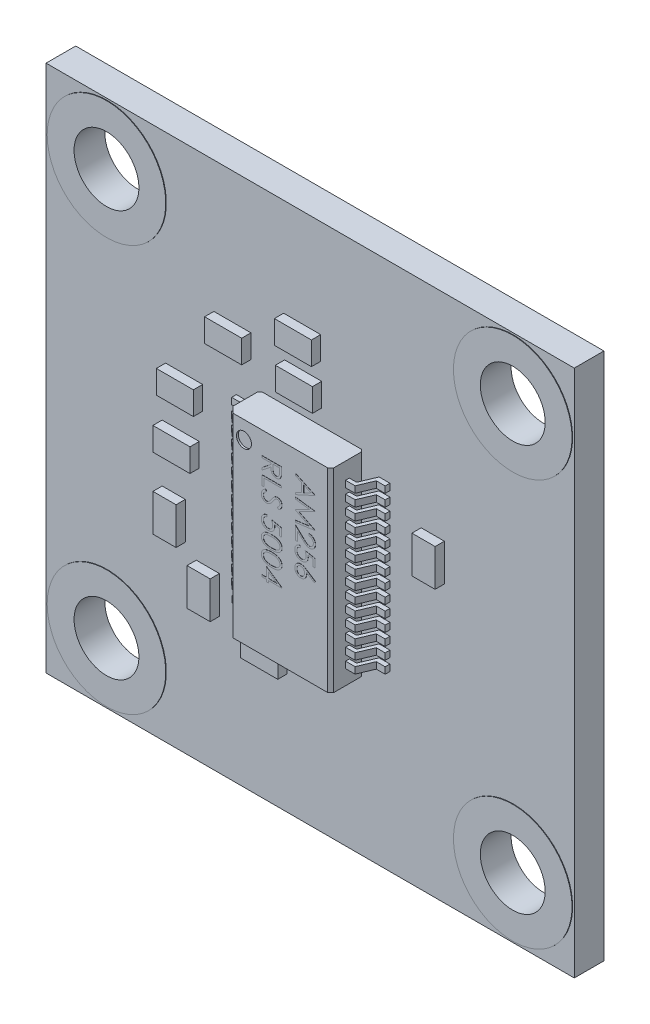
from build123d import *

# Parameters (mm, degrees)
SKETCH1_R                = 0.005
BASE_EXTRUDE_DEPTH       = 1.86
SKETCH5_R                = 0.404245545
CUT_EXTRUDE5_DEPTH       = 0.1
CUT_EXTRUDE9_DEPTH       = 11
BOSS_EXTRUDE1_DEPTH      = 0.01
SKETCH7_W                = 28.5
SKETCH7_H                = 28.5
SKETCH7_R                = 1.75
EXTRUDE1_DEPTH           = 1.6
SKETCH14_W               = 2.032996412
SKETCH14_H               = 4.399768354
BOSS_EXTRUDE2_DEPTH      = 1.8
SKETCH12_W               = 2
SKETCH12_H               = 1.25
SKETCH12_W_2             = 1.25
SKETCH12_H_2             = 2
EXTRUDE6_DEPTH           = 0.5
SKETCH13_W               = 1
SKETCH13_H               = 3
SKETCH13_W_2             = 3
SKETCH13_H_2             = 1
EXTRUDE7_DEPTH           = 0.05
SKETCH16_W               = 2.364526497
SKETCH16_H               = 0.264562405
CUT_EXTRUDE10_DEPTH      = 0.03
BOSS_EXTRUDE3_DEPTH      = 0.03
BOSS_EXTRUDE3_DEPTH_BACK = 1.63
SKETCH17_R               = 3.2
SKETCH17_R_2             = 1.75


with BuildPart() as part:
    # Sketch1 → Base-Extrude (new body)
    with BuildSketch(Plane.XY):
        Polygon((7.968512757, 8.897793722), (9.301851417, 8.897793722), (9.301851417, 8.547793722), (7.968512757, 8.547793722), (7.968512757, 8.247793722), (9.301851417, 8.247793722), (9.301851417, 7.897793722), (7.968512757, 7.897793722), (7.968512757, 7.597793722), (9.301851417, 7.597793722), (9.301851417, 7.247793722), (7.968512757, 7.247793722), (7.968512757, 6.947793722), (9.301851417, 6.947793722), (9.301851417, 6.597793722), (7.968512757, 6.597793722), (7.968512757, 6.297793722), (9.301851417, 6.297793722), (9.301851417, 5.947793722), (7.968512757, 5.947793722), (7.968512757, 5.647793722), (9.301851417, 5.647793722), (9.301851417, 5.297793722), (7.968512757, 5.297793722), (7.968512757, 4.997793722), (9.301851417, 4.997793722), (9.301851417, 4.647793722), (7.968512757, 4.647793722), (7.968512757, 4.347793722), (9.301851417, 4.347793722), (9.301851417, 3.997793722), (7.968512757, 3.997793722), (7.968512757, 3.697793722), (9.301851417, 3.697793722), (9.301851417, 3.347793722), (7.968512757, 3.347793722), (7.968512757, 3.047793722), (9.301851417, 3.047793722), (9.301851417, 2.697793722), (7.968512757, 2.697793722), (7.968512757, 2.397793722), (9.301851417, 2.397793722), (9.301851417, 2.047793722), (7.968512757, 2.047793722), (7.968512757, 1.747793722), (9.301851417, 1.747793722), (9.301851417, 1.397793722), (7.968512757, 1.397793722), (7.968512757, 1.097793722), (9.301851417, 1.097793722), (9.301851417, 0.747793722), (7.968512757, 0.747793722), (7.968512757, 0.447793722), (9.301851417, 0.447793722), (9.301851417, 0.097793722), (7.968512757, 0.097793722), (7.968512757, -0.702206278), (2.368512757, -0.702206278), (2.368512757, 0.097793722), (1.018512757, 0.097793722), (1.018512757, 0.447793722), (2.368512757, 0.447793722), (2.368512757, 0.747793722), (1.018512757, 0.747793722), (1.018512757, 1.097793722), (2.368512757, 1.097793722), (2.368512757, 1.397793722), (1.018512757, 1.397793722), (1.018512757, 1.747793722), (2.368512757, 1.747793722), (2.368512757, 2.047793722), (1.018512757, 2.047793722), (1.018512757, 2.397793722), (2.368512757, 2.397793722), (2.368512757, 2.697793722), (1.018512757, 2.697793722), (1.018512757, 3.047793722), (2.368512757, 3.047793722), (2.368512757, 3.347793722), (1.018512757, 3.347793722), (1.018512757, 3.697793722), (2.368512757, 3.697793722), (2.368512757, 3.997793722), (1.018512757, 3.997793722), (1.018512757, 4.347793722), (2.368512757, 4.347793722), (2.368512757, 4.647793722), (1.018512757, 4.647793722), (1.018512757, 4.997793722), (2.368512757, 4.997793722), (2.368512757, 5.297793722), (1.018512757, 5.297793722), (1.018512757, 5.647793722), (2.368512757, 5.647793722), (2.368512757, 5.947793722), (1.018512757, 5.947793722), (1.018512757, 6.297793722), (2.368512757, 6.297793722), (2.368512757, 6.597793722), (1.018512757, 6.597793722), (1.018512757, 6.947793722), (2.368512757, 6.947793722), (2.368512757, 7.247793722), (1.018512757, 7.247793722), (1.018512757, 7.597793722), (2.368512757, 7.597793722), (2.368512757, 7.897793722), (1.018512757, 7.897793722), (1.018512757, 8.247793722), (2.368512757, 8.247793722), (2.368512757, 8.547793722), (1.018512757, 8.547793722), (1.018512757, 8.897793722), (2.368512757, 8.897793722), (2.368512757, 9.797793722), (7.968512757, 9.797793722), align=None)
        with Locations((5.168512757, 4.547793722)):
            Circle(SKETCH1_R, mode=Mode.SUBTRACT)
    extrude(amount=BASE_EXTRUDE_DEPTH)

    # Sketch5 → Cut-Extrude5 (cut)
    with BuildSketch(Plane.XY.offset(1.86)):
        with Locations((3.288537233, 8.84582504)):
            Circle(SKETCH5_R)
    extrude(amount=-CUT_EXTRUDE5_DEPTH, mode=Mode.SUBTRACT)

    # Sketch15 → Cut-Extrude9 (cut)
    with BuildSketch(Plane(origin=(0, 9.797793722, 0), x_dir=(1, 0, 0), z_dir=(0, 1, 0))):
        Polygon((1.018512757, -0.2554117), (1.515038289, -0.2554117), (1.85430492, -1.060183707), (2.368512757, -1.060183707), (2.368512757, -1.533579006), (2.706416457, -1.86), (2.651187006, -2.385690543), (0.552467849, -2.385690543), (0.552467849, -0.2554117), align=None)
        Polygon((1.617607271, 0), (1.978441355, -0.855932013), (2.368512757, -0.855932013), (2.368512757, -0.187465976), (2.485498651, -0.081833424), (7.851526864, -0.081833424), (7.968512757, -0.187465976), (7.968512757, -0.855932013), (8.35858416, -0.855932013), (8.719418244, 0), align=None)
        Polygon((9.784557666, -2.385690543), (7.747123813, -2.38958058), (7.802761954, -1.86), (7.968512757, -1.696789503), (7.968512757, -1.060183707), (8.482720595, -1.060183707), (8.821987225, -0.2554117), (9.784557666, -0.2554117), align=None)
    extrude(amount=-CUT_EXTRUDE9_DEPTH, mode=Mode.SUBTRACT)

    # Sketch6 → Boss-Extrude1 (add)
    # profile 1 of 12: a face of its own
    with BuildSketch(Plane.XY.offset(1.86)):
        Polygon((7.124163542, 8.168306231), (6.065830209, 7.679844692), (6.065830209, 7.783091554), (6.40503961, 7.939551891), (6.40503961, 8.419321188), (6.065830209, 8.580233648), (6.065830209, 8.683904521), (7.124163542, 8.181874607), align=None)
        Polygon((6.917881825, 8.176150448), (6.513586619, 8.36780376), (6.513586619, 7.989585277), align=None, mode=Mode.SUBTRACT)
    # profile 2 of 12: a face of its own
    with BuildSketch(Plane.XY.offset(1.86)):
        Polygon((6.065830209, 7.571297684), (7.124163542, 7.431585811), (7.124163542, 7.418017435), (6.255787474, 6.981073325), (7.124163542, 6.545189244), (7.124163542, 6.531408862), (6.065830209, 6.390848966), (6.065830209, 6.48625161), (6.827355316, 6.587590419), (6.065830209, 6.969625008), (6.065830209, 6.991037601), (6.829051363, 7.374556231), (6.065830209, 7.475683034), align=None)
    # profile 3 of 12: a face of its own
    with BuildSketch(Plane.XY.offset(1.86)):
        with BuildLine():
            Line((6.798522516, 6.133049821), (6.798522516, 6.228028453))
            add(Edge.make_bspline(
                [(6.798522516, 6.228028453), (6.811123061, 6.227409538), (6.835870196, 6.226194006), (6.871950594, 6.220499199), (6.906441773, 6.212358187), (6.939048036, 6.200820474), (6.970158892, 6.186572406), (6.999361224, 6.169128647), (7.026944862, 6.148861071), (7.052387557, 6.125806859), (7.075645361, 6.100790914), (7.095942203, 6.073963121), (7.112894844, 6.045599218), (7.12714393, 6.015945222), (7.137826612, 5.984658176), (7.145756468, 5.952037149), (7.150526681, 5.917934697), (7.151039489, 5.894699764), (7.151300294, 5.882882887)],
                knots=[0, 0, 0, 0, 1.100776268, 2.161895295, 3.184016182, 4.190939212, 5.176500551, 6.166955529, 7.155448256, 8.160289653, 9.16017456, 10.133824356, 11.091467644, 12.04088621, 13.000931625, 13.972173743, 14.968683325, 16, 16, 16, 16], degree=3))
            add(Edge.make_bspline(
                [(7.151300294, 5.882882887), (7.151028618, 5.871278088), (7.150494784, 5.848475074), (7.145910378, 5.815194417), (7.138730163, 5.783511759), (7.128656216, 5.753489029), (7.115114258, 5.725365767), (7.098846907, 5.698930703), (7.080032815, 5.673869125), (7.057882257, 5.651309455), (7.034235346, 5.630593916), (7.008990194, 5.61272252), (6.9829161, 5.597418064), (6.95581424, 5.584661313), (6.927429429, 5.575270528), (6.898174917, 5.568140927), (6.867747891, 5.564110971), (6.847153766, 5.563492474), (6.836683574, 5.563178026)],
                knots=[0, 0, 0, 0, 1.111607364, 2.184268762, 3.212621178, 4.221274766, 5.211760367, 6.196651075, 7.1921475, 8.207485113, 9.220403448, 10.201281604, 11.166441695, 12.114753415, 13.065576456, 14.026450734, 14.996634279, 16, 16, 16, 16], degree=3))
            add(Edge.make_bspline(
                [(6.836683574, 5.563178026), (6.821943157, 5.563690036), (6.792720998, 5.564705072), (6.749778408, 5.573387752), (6.708172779, 5.586948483), (6.674687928, 5.603276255), (6.647705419, 5.619747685), (6.625489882, 5.634590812), (6.601569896, 5.651967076), (6.576025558, 5.672129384), (6.548656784, 5.694660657), (6.519480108, 5.719764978), (6.488796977, 5.747621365), (6.467840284, 5.767172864), (6.45698105, 5.777303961)],
                knots=[0, 0, 0, 0, 1.184426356, 2.348067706, 3.509069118, 4.696110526, 5.333549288, 6.050745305, 6.844228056, 7.710549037, 8.667450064, 9.695053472, 10.805634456, 12, 12, 12, 12], degree=3))
            Line((6.45698105, 5.777303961), (6.174377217, 6.0420993))
            Line((6.174377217, 6.0420993), (6.174377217, 5.54960965))
            Line((6.174377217, 5.54960965), (6.065830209, 5.54960965))
            Line((6.065830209, 5.54960965), (6.065830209, 6.268733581))
            Line((6.065830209, 6.268733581), (6.503834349, 5.858290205))
            add(Edge.make_bspline(
                [(6.503834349, 5.858290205), (6.514265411, 5.848296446), (6.534301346, 5.82910048), (6.563562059, 5.801961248), (6.590675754, 5.777546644), (6.615762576, 5.755840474), (6.638680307, 5.736824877), (6.659608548, 5.720560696), (6.678367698, 5.706976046), (6.700405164, 5.692579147), (6.727343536, 5.678850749), (6.760098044, 5.666784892), (6.793890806, 5.659480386), (6.816720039, 5.658599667), (6.828203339, 5.658156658)],
                knots=[0, 0, 0, 0, 1.329530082, 2.553755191, 3.672934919, 4.687409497, 5.60679272, 6.413407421, 7.126401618, 7.737995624, 8.834647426, 9.90044882, 10.943907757, 12, 12, 12, 12], degree=3))
            add(Edge.make_bspline(
                [(6.828203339, 5.658156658), (6.835425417, 5.65834692), (6.849658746, 5.658721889), (6.870513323, 5.662093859), (6.890707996, 5.667047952), (6.90999307, 5.674683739), (6.928747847, 5.683857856), (6.946402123, 5.695578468), (6.963557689, 5.708972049), (6.979626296, 5.724507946), (6.994347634, 5.741563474), (7.007387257, 5.759584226), (7.018284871, 5.778649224), (7.027218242, 5.798679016), (7.034226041, 5.819617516), (7.039081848, 5.841505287), (7.0421306, 5.864281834), (7.042543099, 5.879834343), (7.042753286, 5.887759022)],
                knots=[0, 0, 0, 0, 0.991504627, 1.954065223, 2.895985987, 3.842598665, 4.797835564, 5.759220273, 6.74786863, 7.784730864, 8.824135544, 9.839918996, 10.835834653, 11.835434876, 12.84861661, 13.863796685, 14.911511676, 16, 16, 16, 16], degree=3))
            add(Edge.make_bspline(
                [(7.042753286, 5.887759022), (7.042537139, 5.896035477), (7.042112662, 5.912289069), (7.039141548, 5.93615216), (7.034020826, 5.958919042), (7.027000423, 5.980635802), (7.018161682, 6.001323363), (7.006940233, 6.020794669), (6.993774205, 6.039227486), (6.978765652, 6.05658796), (6.961976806, 6.072539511), (6.943492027, 6.086849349), (6.923191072, 6.099054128), (6.901532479, 6.109873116), (6.877940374, 6.118151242), (6.852986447, 6.125227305), (6.826316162, 6.130367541), (6.80794094, 6.132140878), (6.798522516, 6.133049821)],
                knots=[0, 0, 0, 0, 1.031212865, 2.025131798, 2.990757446, 3.934781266, 4.865570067, 5.788494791, 6.729227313, 7.684356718, 8.643577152, 9.610526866, 10.590658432, 11.59095419, 12.621640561, 13.700587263, 14.82141059, 16, 16, 16, 16], degree=3))
        make_face()
    # profile 4 of 12: a face of its own
    with BuildSketch(Plane.XY.offset(1.86)):
        with BuildLine():
            Line((7.124163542, 4.78978059), (7.015616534, 4.78978059))
            Line((7.015616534, 4.78978059), (7.015616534, 5.149766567))
            Line((7.015616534, 5.149766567), (6.737252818, 5.206796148))
            add(Edge.make_bspline(
                [(6.737252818, 5.206796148), (6.740346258, 5.195591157), (6.746339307, 5.17388326), (6.752993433, 5.141843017), (6.75700465, 5.11142585), (6.757552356, 5.091687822), (6.757817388, 5.082136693)],
                knots=[0, 0, 0, 0, 1.100273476, 2.13160584, 3.095893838, 4, 4, 4, 4], degree=3))
            add(Edge.make_bspline(
                [(6.757817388, 5.082136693), (6.757561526, 5.070318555), (6.757058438, 5.047081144), (6.752229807, 5.013081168), (6.74462452, 4.980627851), (6.734017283, 4.949776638), (6.720365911, 4.920461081), (6.703534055, 4.89284489), (6.683638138, 4.866771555), (6.660870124, 4.842585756), (6.635781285, 4.82067843), (6.608893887, 4.801340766), (6.580183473, 4.78525807), (6.549776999, 4.772026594), (6.517725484, 4.761528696), (6.483791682, 4.754522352), (6.448276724, 4.749862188), (6.423994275, 4.749341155), (6.411611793, 4.749075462)],
                knots=[0, 0, 0, 0, 1.052772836, 2.070014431, 3.053871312, 4.019926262, 4.972333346, 5.930471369, 6.896690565, 7.89035727, 8.885779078, 9.861050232, 10.836829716, 11.812751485, 12.812646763, 13.836748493, 14.896881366, 16, 16, 16, 16], degree=3))
            add(Edge.make_bspline(
                [(6.411611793, 4.749075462), (6.402987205, 4.749276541), (6.385854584, 4.749675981), (6.360411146, 4.751707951), (6.335505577, 4.755617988), (6.31113825, 4.760875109), (6.287341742, 4.767671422), (6.264124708, 4.775988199), (6.24141566, 4.785791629), (6.219213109, 4.796859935), (6.198201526, 4.809663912), (6.178056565, 4.823151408), (6.159519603, 4.838091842), (6.141913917, 4.853761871), (6.12593091, 4.870788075), (6.1108866, 4.888641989), (6.097434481, 4.907742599), (6.085061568, 4.927747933), (6.073983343, 4.948645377), (6.064742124, 4.970646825), (6.056642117, 4.993269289), (6.050055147, 5.0167144), (6.044944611, 5.040936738), (6.041464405, 5.066019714), (6.038932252, 5.091837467), (6.038773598, 5.109337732), (6.038693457, 5.118177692)],
                knots=[0, 0, 0, 0, 1.05623316, 2.098192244, 3.122504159, 4.140841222, 5.148757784, 6.150489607, 7.158294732, 8.176043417, 9.185147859, 10.169157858, 11.142149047, 12.097904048, 13.0527185, 13.998867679, 14.954465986, 15.910220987, 16.877849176, 17.847023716, 18.829548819, 19.818454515, 20.826519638, 21.858115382, 22.918063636, 24, 24, 24, 24], degree=3))
            add(Edge.make_bspline(
                [(6.038693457, 5.118177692), (6.038902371, 5.128722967), (6.039313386, 5.14946955), (6.043612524, 5.179865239), (6.049771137, 5.209109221), (6.059031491, 5.236970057), (6.070651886, 5.263682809), (6.085245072, 5.288891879), (6.102013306, 5.313092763), (6.12153515, 5.33562771), (6.143072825, 5.356500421), (6.166194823, 5.375471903), (6.190993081, 5.392109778), (6.217256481, 5.406481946), (6.245030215, 5.41872349), (6.274397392, 5.428344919), (6.305210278, 5.43610924), (6.326423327, 5.439394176), (6.33719773, 5.441062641)],
                knots=[0, 0, 0, 0, 1.046825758, 2.059506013, 3.044032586, 4.011925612, 4.970610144, 5.93275819, 6.900651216, 7.891265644, 8.889116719, 9.876966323, 10.858259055, 11.851035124, 12.847502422, 13.86866322, 14.9174643, 16, 16, 16, 16], degree=3))
            Line((6.33719773, 5.441062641), (6.33719773, 5.346084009))
            add(Edge.make_bspline(
                [(6.33719773, 5.346084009), (6.327104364, 5.343748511), (6.307704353, 5.339259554), (6.280463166, 5.329380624), (6.256096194, 5.317376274), (6.234580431, 5.302777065), (6.215719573, 5.285714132), (6.19876674, 5.266383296), (6.183675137, 5.244509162), (6.171014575, 5.220211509), (6.160232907, 5.194562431), (6.153049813, 5.167721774), (6.148000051, 5.140415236), (6.147494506, 5.121946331), (6.147240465, 5.112665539)],
                knots=[0, 0, 0, 0, 1.136389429, 2.184203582, 3.172920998, 4.111012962, 5.028380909, 5.957351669, 6.927793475, 7.937618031, 8.960409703, 9.974842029, 10.982339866, 12, 12, 12, 12], degree=3))
            add(Edge.make_bspline(
                [(6.147240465, 5.112665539), (6.147488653, 5.103606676), (6.147977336, 5.085769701), (6.151738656, 5.059519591), (6.157531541, 5.034176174), (6.166200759, 5.009989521), (6.176737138, 4.986536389), (6.190258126, 4.964410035), (6.205818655, 4.942970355), (6.223646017, 4.922883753), (6.243291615, 4.904487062), (6.264300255, 4.888232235), (6.286711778, 4.874692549), (6.310138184, 4.863282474), (6.334836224, 4.854618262), (6.36069015, 4.848437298), (6.387763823, 4.844807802), (6.406230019, 4.844308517), (6.415639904, 4.844054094)],
                knots=[0, 0, 0, 0, 1.027316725, 2.022795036, 3.002884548, 3.971462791, 4.93288096, 5.914575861, 6.907176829, 7.935150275, 8.956128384, 9.956726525, 10.942570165, 11.921478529, 12.907843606, 13.90538589, 14.932640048, 16, 16, 16, 16], degree=3))
            add(Edge.make_bspline(
                [(6.415639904, 4.844054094), (6.424134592, 4.844221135), (6.440771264, 4.844548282), (6.465003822, 4.848183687), (6.488098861, 4.853276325), (6.509849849, 4.86109542), (6.530575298, 4.870756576), (6.549831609, 4.883013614), (6.568113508, 4.89702467), (6.584678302, 4.913435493), (6.600070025, 4.931330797), (6.613171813, 4.951125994), (6.624199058, 4.97236957), (6.633714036, 4.994815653), (6.640548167, 5.018995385), (6.645678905, 5.044430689), (6.648646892, 5.071396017), (6.6490587, 5.089832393), (6.64927038, 5.099309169)],
                knots=[0, 0, 0, 0, 1.045726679, 2.048034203, 3.01323695, 3.95502507, 4.889743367, 5.8246644, 6.761650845, 7.722168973, 8.692072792, 9.66525385, 10.638902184, 11.638179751, 12.663148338, 13.728659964, 14.832472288, 16, 16, 16, 16], degree=3))
            add(Edge.make_bspline(
                [(6.64927038, 5.099309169), (6.649100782, 5.107583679), (6.648753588, 5.124522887), (6.646021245, 5.15056689), (6.641817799, 5.177816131), (6.635759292, 5.2063764), (6.628173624, 5.236169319), (6.618700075, 5.267244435), (6.607787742, 5.299602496), (6.599323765, 5.321381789), (6.594996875, 5.332515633)],
                knots=[0, 0, 0, 0, 0.824638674, 1.688163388, 2.607705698, 3.571998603, 4.597075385, 5.671199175, 6.809488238, 8, 8, 8, 8], degree=3))
            Line((6.594996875, 5.332515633), (7.124163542, 5.223968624))
            Line((7.124163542, 5.223968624), (7.124163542, 4.78978059))
        make_face()
    # profile 5 of 12: a face of its own
    with BuildSketch(Plane.XY.offset(1.86)):
        with BuildLine():
            Line((7.151300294, 4.152066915), (7.093846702, 4.078924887))
            Line((7.093846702, 4.078924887), (6.66623085, 4.358560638))
            add(Edge.make_bspline(
                [(6.66623085, 4.358560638), (6.669198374, 4.339942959), (6.674986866, 4.303627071), (6.675941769, 4.266867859), (6.676407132, 4.2489536)],
                knots=[0, 0, 0, 0, 1.025318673, 2, 2, 2, 2], degree=3))
            add(Edge.make_bspline(
                [(6.676407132, 4.2489536), (6.676118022, 4.238197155), (6.675548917, 4.217023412), (6.671169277, 4.185936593), (6.664267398, 4.156064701), (6.654206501, 4.127531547), (6.641354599, 4.100234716), (6.625951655, 4.074017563), (6.607202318, 4.049372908), (6.586257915, 4.025983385), (6.56306016, 4.004748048), (6.538445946, 3.985947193), (6.512440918, 3.970154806), (6.485058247, 3.957341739), (6.456340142, 3.947391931), (6.426323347, 3.940138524), (6.394987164, 3.935850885), (6.373675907, 3.935268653), (6.362850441, 3.934972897)],
                knots=[0, 0, 0, 0, 1.04369286, 2.054478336, 3.041073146, 4.015093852, 4.984733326, 5.965804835, 6.960378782, 7.985147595, 9.009457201, 10.008161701, 10.986880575, 11.956520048, 12.937015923, 13.931873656, 14.949455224, 16, 16, 16, 16], degree=3))
            add(Edge.make_bspline(
                [(6.362850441, 3.934972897), (6.348048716, 3.935525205), (6.318939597, 3.936611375), (6.276365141, 3.944518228), (6.236130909, 3.95816369), (6.198078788, 3.976419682), (6.163315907, 4.000105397), (6.131899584, 4.028174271), (6.104515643, 4.060891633), (6.081024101, 4.09748273), (6.062360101, 4.137085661), (6.048561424, 4.178610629), (6.040316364, 4.221702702), (6.039236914, 4.250968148), (6.038693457, 4.265702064)],
                knots=[0, 0, 0, 0, 1.031881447, 2.029301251, 3.006342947, 3.987068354, 4.962916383, 5.929513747, 6.915671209, 7.928552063, 8.953527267, 9.960179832, 10.973036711, 12, 12, 12, 12], degree=3))
            add(Edge.make_bspline(
                [(6.038693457, 4.265702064), (6.039155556, 4.279943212), (6.040070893, 4.308152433), (6.048224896, 4.349648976), (6.061441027, 4.389521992), (6.079648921, 4.427491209), (6.102646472, 4.462666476), (6.130336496, 4.494126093), (6.162107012, 4.521760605), (6.198055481, 4.544637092), (6.236435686, 4.563281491), (6.276819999, 4.576431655), (6.318395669, 4.584935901), (6.346696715, 4.5858133), (6.360942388, 4.586254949)],
                knots=[0, 0, 0, 0, 1.011913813, 2.004424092, 2.994488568, 3.992479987, 4.990471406, 5.973328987, 6.963763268, 7.974390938, 8.994854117, 9.989689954, 10.988086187, 12, 12, 12, 12], degree=3))
            add(Edge.make_bspline(
                [(6.360942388, 4.586254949), (6.371837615, 4.585871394), (6.394073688, 4.585088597), (6.427848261, 4.580416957), (6.462271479, 4.571848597), (6.49145295, 4.562575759), (6.515620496, 4.553374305), (6.534704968, 4.544842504), (6.554858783, 4.535302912), (6.575700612, 4.524121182), (6.59782595, 4.512267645), (6.620415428, 4.498421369), (6.644294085, 4.483972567), (6.660192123, 4.473387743), (6.668350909, 4.46795567)],
                knots=[0, 0, 0, 0, 1.17367173, 2.395347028, 3.66355231, 4.98980831, 5.690886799, 6.447442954, 7.240630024, 8.091733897, 8.994365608, 9.943299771, 10.944512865, 12, 12, 12, 12], degree=3))
            Line((6.668350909, 4.46795567), (7.151300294, 4.152066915))
        make_face()
        with BuildLine():
            add(Edge.make_bspline(
                [(6.567860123, 4.268882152), (6.567621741, 4.276944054), (6.567154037, 4.29276144), (6.564512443, 4.315938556), (6.559507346, 4.337814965), (6.553033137, 4.35864053), (6.544218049, 4.378198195), (6.533637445, 4.396711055), (6.521057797, 4.413995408), (6.506619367, 4.429747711), (6.491042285, 4.444212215), (6.474257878, 4.456654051), (6.456778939, 4.467398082), (6.438441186, 4.476130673), (6.419256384, 4.482931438), (6.399311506, 4.487850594), (6.378473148, 4.49058829), (6.364342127, 4.491043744), (6.357126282, 4.491276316)],
                knots=[0, 0, 0, 0, 1.129474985, 2.216020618, 3.260639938, 4.268601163, 5.26556745, 6.258792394, 7.250684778, 8.252748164, 9.247500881, 10.223461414, 11.174097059, 12.117127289, 13.062595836, 14.020469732, 14.98917545, 16, 16, 16, 16], degree=3))
            add(Edge.make_bspline(
                [(6.357126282, 4.491276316), (6.349975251, 4.491086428), (6.335953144, 4.490714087), (6.315284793, 4.487348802), (6.295413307, 4.482171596), (6.276324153, 4.474593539), (6.258121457, 4.46508844), (6.240675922, 4.453391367), (6.223975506, 4.43970038), (6.208441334, 4.42378488), (6.194193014, 4.406621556), (6.181506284, 4.388470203), (6.170852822, 4.369388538), (6.162430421, 4.349267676), (6.155532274, 4.328389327), (6.15067463, 4.306594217), (6.147929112, 4.283863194), (6.147473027, 4.268465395), (6.147240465, 4.260613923)],
                knots=[0, 0, 0, 0, 0.989642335, 1.94054129, 2.892446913, 3.828371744, 4.778262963, 5.730973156, 6.732161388, 7.763274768, 8.805796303, 9.818398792, 10.825975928, 11.825728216, 12.834635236, 13.867465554, 14.912602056, 16, 16, 16, 16], degree=3))
            add(Edge.make_bspline(
                [(6.147240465, 4.260613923), (6.147473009, 4.252762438), (6.147929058, 4.237364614), (6.150674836, 4.214633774), (6.155531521, 4.192837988), (6.162433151, 4.171962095), (6.170842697, 4.151832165), (6.18157304, 4.132733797), (6.194115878, 4.114409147), (6.208465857, 4.097257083), (6.223887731, 4.08127506), (6.240827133, 4.067904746), (6.257982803, 4.055838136), (6.276396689, 4.046698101), (6.295401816, 4.039035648), (6.315287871, 4.033884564), (6.335952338, 4.030512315), (6.349974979, 4.03014093), (6.357126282, 4.02995153)],
                knots=[0, 0, 0, 0, 1.087205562, 2.132157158, 3.164804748, 4.173533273, 5.173108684, 6.180507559, 7.20098426, 8.243321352, 9.274252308, 10.269075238, 11.227079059, 12.172305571, 13.108064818, 14.05980203, 15.010532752, 16, 16, 16, 16], degree=3))
            add(Edge.make_bspline(
                [(6.357126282, 4.02995153), (6.364352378, 4.030115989), (6.378534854, 4.030438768), (6.399292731, 4.034160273), (6.419418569, 4.039186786), (6.438458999, 4.047310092), (6.456940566, 4.056985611), (6.474335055, 4.069311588), (6.491135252, 4.083443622), (6.506722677, 4.099809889), (6.520980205, 4.117614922), (6.533564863, 4.136549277), (6.544186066, 4.156357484), (6.553047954, 4.177020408), (6.559443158, 4.198774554), (6.56447878, 4.221268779), (6.567158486, 4.244790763), (6.567623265, 4.260749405), (6.567860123, 4.268882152)],
                knots=[0, 0, 0, 0, 0.978265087, 1.920016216, 2.851775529, 3.783928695, 4.718195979, 5.674835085, 6.667117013, 7.690134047, 8.732874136, 9.755756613, 10.767227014, 11.776017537, 12.797239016, 13.836276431, 14.897336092, 16, 16, 16, 16], degree=3))
        make_face(mode=Mode.SUBTRACT)
    # profile 6 of 12: a face of its own
    with BuildSketch(Plane.XY.offset(1.86)):
        with BuildLine():
            Line((5.319569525, 8.602494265), (5.319569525, 8.390700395))
            add(Edge.make_bspline(
                [(5.319569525, 8.390700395), (5.319522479, 8.376566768), (5.319432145, 8.349428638), (5.31892845, 8.310550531), (5.317484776, 8.275224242), (5.316242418, 8.243468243), (5.313976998, 8.215283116), (5.311811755, 8.190582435), (5.308977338, 8.169479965), (5.306344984, 8.156705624), (5.305153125, 8.150921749)],
                knots=[0, 0, 0, 0, 1.410062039, 2.707475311, 3.878576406, 4.937260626, 5.877586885, 6.699081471, 7.410979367, 8, 8, 8, 8], degree=3))
            add(Edge.make_bspline(
                [(5.305153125, 8.150921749), (5.303240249, 8.143178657), (5.299455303, 8.127857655), (5.291451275, 8.105800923), (5.2822041, 8.084773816), (5.271258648, 8.064855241), (5.258805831, 8.046043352), (5.244772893, 8.028366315), (5.229088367, 8.011925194), (5.212152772, 7.996593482), (5.193818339, 7.98269578), (5.174352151, 7.970669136), (5.153875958, 7.960370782), (5.132318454, 7.952149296), (5.109861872, 7.945535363), (5.086310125, 7.940870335), (5.061768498, 7.93807307), (5.045029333, 7.937788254), (5.03654168, 7.937643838)],
                knots=[0, 0, 0, 0, 1.02737288, 2.032829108, 3.019628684, 3.985738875, 4.958353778, 5.924249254, 6.890702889, 7.883913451, 8.865824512, 9.85161466, 10.829249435, 11.81541824, 12.821369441, 13.843154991, 14.906364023, 16, 16, 16, 16], degree=3))
            add(Edge.make_bspline(
                [(5.03654168, 7.937643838), (5.022440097, 7.938088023), (4.994924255, 7.938954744), (4.954991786, 7.947036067), (4.917740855, 7.960272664), (4.883223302, 7.978515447), (4.852093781, 8.001736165), (4.824844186, 8.029642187), (4.801830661, 8.062091), (4.786041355, 8.092440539), (4.775881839, 8.11926245), (4.768697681, 8.141408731), (4.763240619, 8.165584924), (4.758280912, 8.191444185), (4.754496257, 8.219186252), (4.751808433, 8.248755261), (4.750080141, 8.280225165), (4.749827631, 8.30179695), (4.74969773, 8.312894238)],
                knots=[0, 0, 0, 0, 1.260402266, 2.459371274, 3.627181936, 4.786749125, 5.93865593, 7.087644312, 8.261344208, 9.485713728, 10.136162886, 10.825977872, 11.566646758, 12.35154167, 13.181268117, 14.0701832, 15.007234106, 16, 16, 16, 16], degree=3))
            Line((4.74969773, 8.312894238), (4.261236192, 7.924075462))
            Line((4.261236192, 7.924075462), (4.261236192, 8.041526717))
            Line((4.261236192, 8.041526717), (4.74969773, 8.430345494))
            Line((4.74969773, 8.430345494), (4.74969773, 8.507515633))
            Line((4.74969773, 8.507515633), (4.261236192, 8.507515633))
            Line((4.261236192, 8.507515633), (4.261236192, 8.602494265))
            Line((4.261236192, 8.602494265), (5.319569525, 8.602494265))
        make_face()
        with BuildLine():
            Line((5.211022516, 8.507515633), (4.858244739, 8.507515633))
            Line((4.858244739, 8.507515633), (4.856760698, 8.313742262))
            add(Edge.make_bspline(
                [(4.856760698, 8.313742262), (4.856756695, 8.304695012), (4.856748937, 8.287158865), (4.857956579, 8.261788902), (4.859330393, 8.23816687), (4.861431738, 8.216383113), (4.864139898, 8.196427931), (4.86752742, 8.178311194), (4.87147427, 8.162003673), (4.877582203, 8.142983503), (4.887264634, 8.121751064), (4.901327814, 8.098647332), (4.919130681, 8.079039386), (4.939164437, 8.062133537), (4.961644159, 8.049111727), (4.985572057, 8.039634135), (5.010741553, 8.033686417), (5.028029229, 8.032979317), (5.036753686, 8.03262247)],
                knots=[0, 0, 0, 0, 1.14660753, 2.222451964, 3.218720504, 4.145691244, 4.995719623, 5.770487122, 6.480909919, 7.121111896, 8.299844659, 9.430703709, 10.534634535, 11.641396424, 12.741395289, 13.810956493, 14.895269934, 16, 16, 16, 16], degree=3))
            add(Edge.make_bspline(
                [(5.036753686, 8.03262247), (5.045267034, 8.032980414), (5.062137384, 8.033689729), (5.086767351, 8.039645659), (5.110179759, 8.049263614), (5.131928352, 8.062750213), (5.151834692, 8.0790467), (5.168631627, 8.098401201), (5.18269808, 8.119839), (5.191621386, 8.139889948), (5.197103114, 8.157799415), (5.200955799, 8.173351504), (5.204077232, 8.190990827), (5.206504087, 8.210675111), (5.208687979, 8.232368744), (5.210103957, 8.256131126), (5.210959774, 8.281934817), (5.211001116, 8.299819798), (5.211022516, 8.309078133)],
                knots=[0, 0, 0, 0, 1.100801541, 2.181386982, 3.260112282, 4.364594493, 5.481957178, 6.577424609, 7.668452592, 8.790448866, 9.403819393, 10.091598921, 10.863153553, 11.720938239, 12.658472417, 13.685008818, 14.801622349, 16, 16, 16, 16], degree=3))
            Line((5.211022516, 8.309078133), (5.211022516, 8.507515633))
        make_face(mode=Mode.SUBTRACT)
    # profile 7 of 12: a face of its own
    with BuildSketch(Plane.XY.offset(1.86)):
        Polygon((5.319569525, 7.706981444), (5.319569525, 7.612002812), (4.3697832, 7.612002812), (4.3697832, 7.20495153), (4.261236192, 7.20495153), (4.261236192, 7.706981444), align=None)
    # profile 8 of 12: a face of its own
    with BuildSketch(Plane.XY.offset(1.86)):
        with BuildLine():
            Line((4.46539785, 7.13710965), (4.519035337, 7.04764317))
            add(Edge.make_bspline(
                [(4.519035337, 7.04764317), (4.505106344, 7.039322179), (4.478418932, 7.023379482), (4.442357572, 6.996784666), (4.411707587, 6.96922781), (4.386647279, 6.940504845), (4.366917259, 6.910791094), (4.352946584, 6.879892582), (4.344233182, 6.847913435), (4.343174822, 6.826149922), (4.342646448, 6.81528473)],
                knots=[0, 0, 0, 0, 1.272034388, 2.437168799, 3.508375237, 4.49857839, 5.41946034, 6.295179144, 7.148887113, 8, 8, 8, 8], degree=3))
            add(Edge.make_bspline(
                [(4.342646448, 6.81528473), (4.342904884, 6.806005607), (4.343417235, 6.787609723), (4.348340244, 6.760527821), (4.355903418, 6.734226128), (4.366735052, 6.709247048), (4.379839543, 6.685934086), (4.39566888, 6.665493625), (4.413387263, 6.647811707), (4.433168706, 6.633387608), (4.454369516, 6.622190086), (4.476325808, 6.614087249), (4.498941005, 6.608930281), (4.514273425, 6.608273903), (4.522003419, 6.607942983)],
                knots=[0, 0, 0, 0, 1.095270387, 2.171376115, 3.241375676, 4.322296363, 5.380636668, 6.392615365, 7.366724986, 8.328592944, 9.273498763, 10.190095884, 11.087518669, 12, 12, 12, 12], degree=3))
            add(Edge.make_bspline(
                [(4.522003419, 6.607942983), (4.530815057, 6.608388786), (4.548727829, 6.60929504), (4.57515582, 6.616954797), (4.601309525, 6.62900445), (4.617487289, 6.640120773), (4.625886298, 6.645892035)],
                knots=[0, 0, 0, 0, 0.938893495, 1.908633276, 2.914225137, 4, 4, 4, 4], degree=3))
            add(Edge.make_bspline(
                [(4.625886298, 6.645892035), (4.631960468, 6.650617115), (4.644749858, 6.660565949), (4.663468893, 6.677906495), (4.683249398, 6.697725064), (4.704011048, 6.720120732), (4.725374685, 6.745538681), (4.747785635, 6.773456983), (4.771176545, 6.804020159), (4.786644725, 6.825559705), (4.794642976, 6.836697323)],
                knots=[0, 0, 0, 0, 0.72226686, 1.520759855, 2.393439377, 3.351307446, 4.386958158, 5.510256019, 6.712608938, 8, 8, 8, 8], degree=3))
            add(Edge.make_bspline(
                [(4.794642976, 6.836697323), (4.802575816, 6.847830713), (4.817742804, 6.869116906), (4.840223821, 6.898908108), (4.860908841, 6.925512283), (4.879509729, 6.949064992), (4.896837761, 6.968956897), (4.911964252, 6.985915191), (4.925696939, 6.999314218), (4.93459842, 7.006770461), (4.938594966, 7.01011813)],
                knots=[0, 0, 0, 0, 1.452255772, 2.776602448, 3.96446981, 5.032613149, 5.964194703, 6.766668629, 7.446264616, 8, 8, 8, 8], degree=3))
            add(Edge.make_bspline(
                [(4.938594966, 7.01011813), (4.944824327, 7.014796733), (4.957075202, 7.023997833), (4.976223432, 7.036143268), (4.995824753, 7.046466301), (5.015931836, 7.05455872), (5.036262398, 7.061373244), (5.057081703, 7.065956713), (5.078296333, 7.068826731), (5.092572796, 7.069120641), (5.099719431, 7.069267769)],
                knots=[0, 0, 0, 0, 1.068054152, 2.10047183, 3.106115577, 4.101338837, 5.06977816, 6.043150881, 7.020423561, 8, 8, 8, 8], degree=3))
            add(Edge.make_bspline(
                [(5.099719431, 7.069267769), (5.110917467, 7.068874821), (5.133074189, 7.068097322), (5.165424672, 7.061468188), (5.196405, 7.051127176), (5.22533277, 7.036171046), (5.252140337, 7.017679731), (5.276418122, 6.995825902), (5.297001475, 6.96987929), (5.314776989, 6.941252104), (5.328811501, 6.910119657), (5.339454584, 6.877555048), (5.345404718, 6.843415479), (5.346268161, 6.820253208), (5.346706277, 6.808500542)],
                knots=[0, 0, 0, 0, 1.005541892, 1.989591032, 2.955705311, 3.932863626, 4.905387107, 5.876519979, 6.856563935, 7.871847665, 8.897921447, 9.918317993, 10.943742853, 12, 12, 12, 12], degree=3))
            add(Edge.make_bspline(
                [(5.346706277, 6.808500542), (5.346284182, 6.796027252), (5.345447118, 6.771291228), (5.337908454, 6.734837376), (5.325731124, 6.699672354), (5.311705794, 6.671366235), (5.297760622, 6.649250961), (5.285053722, 6.632386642), (5.270426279, 6.615296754), (5.253837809, 6.59784394), (5.235136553, 6.58032378), (5.214450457, 6.562476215), (5.191905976, 6.544259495), (5.175811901, 6.532540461), (5.167561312, 6.526532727)],
                knots=[0, 0, 0, 0, 1.286821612, 2.551921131, 3.825787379, 5.12137259, 5.803616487, 6.523126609, 7.299589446, 8.125436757, 9.008162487, 9.944516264, 10.946261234, 12, 12, 12, 12], degree=3))
            Line((5.167561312, 6.526532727), (5.102475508, 6.612395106))
            add(Edge.make_bspline(
                [(5.102475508, 6.612395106), (5.109154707, 6.61757971), (5.122017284, 6.627564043), (5.140030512, 6.642722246), (5.156485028, 6.657009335), (5.170777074, 6.671085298), (5.183689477, 6.684206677), (5.194744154, 6.696942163), (5.204051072, 6.709107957), (5.213978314, 6.724445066), (5.223881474, 6.743762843), (5.23208298, 6.767988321), (5.237188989, 6.793235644), (5.237832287, 6.81038433), (5.238159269, 6.819100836)],
                knots=[0, 0, 0, 0, 1.181667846, 2.275615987, 3.290305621, 4.226321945, 5.078535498, 5.862783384, 6.581873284, 7.217493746, 8.414623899, 9.604724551, 10.782505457, 12, 12, 12, 12], degree=3))
            add(Edge.make_bspline(
                [(5.238159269, 6.819100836), (5.237792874, 6.830033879), (5.237086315, 6.851117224), (5.229369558, 6.881049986), (5.217219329, 6.907990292), (5.200190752, 6.931138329), (5.180015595, 6.950411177), (5.156799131, 6.96435259), (5.131162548, 6.972743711), (5.113279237, 6.973767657), (5.104171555, 6.974289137)],
                knots=[0, 0, 0, 0, 1.14458467, 2.207223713, 3.21896685, 4.227309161, 5.202851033, 6.127160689, 7.046193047, 8, 8, 8, 8], degree=3))
            add(Edge.make_bspline(
                [(5.104171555, 6.974289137), (5.098502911, 6.974164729), (5.087156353, 6.973915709), (5.070348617, 6.970676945), (5.053690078, 6.966084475), (5.037106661, 6.959363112), (5.02020823, 6.950309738), (5.003040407, 6.937999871), (4.985169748, 6.922599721), (4.973558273, 6.910779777), (4.967427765, 6.904539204)],
                knots=[0, 0, 0, 0, 0.858526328, 1.718456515, 2.587092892, 3.476767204, 4.426280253, 5.487868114, 6.673670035, 8, 8, 8, 8], degree=3))
            add(Edge.make_bspline(
                [(4.967427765, 6.904539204), (4.965360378, 6.90222255), (4.960448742, 6.896718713), (4.952407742, 6.886656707), (4.942488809, 6.873369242), (4.930215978, 6.85720329), (4.91597944, 6.837860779), (4.899961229, 6.81533958), (4.88164134, 6.789890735), (4.868833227, 6.771831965), (4.862060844, 6.762283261)],
                knots=[0, 0, 0, 0, 0.420754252, 0.999615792, 1.744751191, 2.668019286, 3.750313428, 4.999500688, 6.413464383, 8, 8, 8, 8], degree=3))
            add(Edge.make_bspline(
                [(4.862060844, 6.762283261), (4.853702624, 6.750797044), (4.837518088, 6.728555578), (4.813201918, 6.696909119), (4.789420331, 6.668215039), (4.766325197, 6.642372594), (4.744091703, 6.619126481), (4.72245236, 6.598734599), (4.701562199, 6.580989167), (4.674779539, 6.561884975), (4.641886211, 6.54236392), (4.60158541, 6.525599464), (4.561127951, 6.515028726), (4.533935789, 6.513646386), (4.520519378, 6.51296435)],
                knots=[0, 0, 0, 0, 1.163667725, 2.253281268, 3.268753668, 4.215851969, 5.092017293, 5.902905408, 6.650798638, 7.335211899, 8.59617414, 9.77448103, 10.901945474, 12, 12, 12, 12], degree=3))
            add(Edge.make_bspline(
                [(4.520519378, 6.51296435), (4.511031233, 6.513163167), (4.492239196, 6.513556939), (4.464644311, 6.518079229), (4.43784807, 6.524713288), (4.412157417, 6.534680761), (4.38722859, 6.546941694), (4.363291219, 6.562085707), (4.340674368, 6.580341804), (4.318907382, 6.600632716), (4.299245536, 6.623182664), (4.281660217, 6.646959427), (4.266941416, 6.672117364), (4.255092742, 6.69853471), (4.24567891, 6.726065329), (4.238912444, 6.754738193), (4.23475006, 6.784633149), (4.234318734, 6.804953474), (4.234099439, 6.81528473)],
                knots=[0, 0, 0, 0, 0.983610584, 1.948120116, 2.894308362, 3.843560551, 4.801159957, 5.773581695, 6.77566113, 7.813174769, 8.857584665, 9.875476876, 10.877851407, 11.875574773, 12.875048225, 13.892438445, 14.928473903, 16, 16, 16, 16], degree=3))
            add(Edge.make_bspline(
                [(4.234099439, 6.81528473), (4.234255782, 6.823277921), (4.234566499, 6.839163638), (4.237248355, 6.862597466), (4.24118133, 6.885600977), (4.247177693, 6.907885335), (4.254624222, 6.929728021), (4.263741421, 6.950934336), (4.274594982, 6.971555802), (4.287202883, 6.991616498), (4.301733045, 7.011305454), (4.318524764, 7.030521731), (4.337462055, 7.049485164), (4.358739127, 7.067848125), (4.382128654, 7.08594909), (4.407826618, 7.10345144), (4.435699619, 7.120711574), (4.45531354, 7.131541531), (4.46539785, 7.13710965)],
                knots=[0, 0, 0, 0, 0.915384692, 1.819241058, 2.699029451, 3.586605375, 4.459625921, 5.340865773, 6.228072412, 7.126546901, 8.052715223, 9.028303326, 10.047266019, 11.120332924, 12.245748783, 13.433636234, 14.680528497, 16, 16, 16, 16], degree=3))
        make_face()
    # profile 9 of 12: a face of its own
    with BuildSketch(Plane.XY.offset(1.86)):
        with BuildLine():
            Line((5.319569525, 5.318947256), (5.211022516, 5.318947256))
            Line((5.211022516, 5.318947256), (5.211022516, 5.678933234))
            Line((5.211022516, 5.678933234), (4.932658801, 5.735962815))
            add(Edge.make_bspline(
                [(4.932658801, 5.735962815), (4.93575224, 5.724757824), (4.94174529, 5.703049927), (4.948399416, 5.671009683), (4.952410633, 5.640592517), (4.952958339, 5.620854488), (4.953223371, 5.61130336)],
                knots=[0, 0, 0, 0, 1.100273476, 2.13160584, 3.095893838, 4, 4, 4, 4], degree=3))
            add(Edge.make_bspline(
                [(4.953223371, 5.61130336), (4.952967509, 5.599485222), (4.952464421, 5.576247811), (4.947635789, 5.542247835), (4.940030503, 5.509794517), (4.929423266, 5.478943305), (4.915771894, 5.449627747), (4.898940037, 5.422011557), (4.879044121, 5.395938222), (4.856276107, 5.371752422), (4.831187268, 5.349845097), (4.80429987, 5.330507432), (4.775589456, 5.314424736), (4.745182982, 5.301193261), (4.713131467, 5.290695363), (4.679197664, 5.283689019), (4.643682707, 5.279028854), (4.619400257, 5.278507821), (4.607017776, 5.278242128)],
                knots=[0, 0, 0, 0, 1.052772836, 2.070014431, 3.053871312, 4.019926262, 4.972333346, 5.930471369, 6.896690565, 7.89035727, 8.885779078, 9.861050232, 10.836829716, 11.812751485, 12.812646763, 13.836748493, 14.896881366, 16, 16, 16, 16], degree=3))
            add(Edge.make_bspline(
                [(4.607017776, 5.278242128), (4.598393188, 5.278443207), (4.581260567, 5.278842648), (4.555817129, 5.280874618), (4.53091156, 5.284784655), (4.506544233, 5.290041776), (4.482747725, 5.296838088), (4.459530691, 5.305154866), (4.436821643, 5.314958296), (4.414619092, 5.326026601), (4.393607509, 5.338830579), (4.373462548, 5.352318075), (4.354925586, 5.367258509), (4.337319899, 5.382928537), (4.321336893, 5.399954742), (4.306292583, 5.417808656), (4.292840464, 5.436909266), (4.280467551, 5.4569146), (4.269389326, 5.477812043), (4.260148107, 5.499813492), (4.252048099, 5.522435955), (4.24546113, 5.545881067), (4.240350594, 5.570103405), (4.236870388, 5.595186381), (4.234338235, 5.621004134), (4.234179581, 5.638504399), (4.234099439, 5.647344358)],
                knots=[0, 0, 0, 0, 1.05623316, 2.098192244, 3.122504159, 4.140841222, 5.148757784, 6.150489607, 7.158294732, 8.176043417, 9.185147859, 10.169157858, 11.142149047, 12.097904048, 13.0527185, 13.998867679, 14.954465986, 15.910220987, 16.877849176, 17.847023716, 18.829548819, 19.818454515, 20.826519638, 21.858115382, 22.918063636, 24, 24, 24, 24], degree=3))
            add(Edge.make_bspline(
                [(4.234099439, 5.647344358), (4.234308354, 5.657889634), (4.234719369, 5.678636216), (4.239018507, 5.709031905), (4.24517712, 5.738275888), (4.254437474, 5.766136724), (4.266057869, 5.792849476), (4.280651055, 5.818058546), (4.297419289, 5.84225943), (4.316941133, 5.864794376), (4.338478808, 5.885667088), (4.361600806, 5.904638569), (4.386399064, 5.921276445), (4.412662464, 5.935648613), (4.440436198, 5.947890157), (4.469803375, 5.957511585), (4.500616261, 5.965275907), (4.521829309, 5.968560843), (4.532603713, 5.970229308)],
                knots=[0, 0, 0, 0, 1.046825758, 2.059506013, 3.044032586, 4.011925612, 4.970610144, 5.93275819, 6.900651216, 7.891265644, 8.889116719, 9.876966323, 10.858259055, 11.851035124, 12.847502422, 13.86866322, 14.9174643, 16, 16, 16, 16], degree=3))
            Line((4.532603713, 5.970229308), (4.532603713, 5.875250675))
            add(Edge.make_bspline(
                [(4.532603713, 5.875250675), (4.522510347, 5.872915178), (4.503110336, 5.868426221), (4.475869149, 5.858547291), (4.451502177, 5.84654294), (4.429986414, 5.831943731), (4.411125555, 5.814880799), (4.394172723, 5.795549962), (4.37908112, 5.773675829), (4.366420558, 5.749378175), (4.355638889, 5.723729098), (4.348455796, 5.696888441), (4.343406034, 5.669581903), (4.342900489, 5.651112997), (4.342646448, 5.641832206)],
                knots=[0, 0, 0, 0, 1.136389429, 2.184203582, 3.172920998, 4.111012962, 5.028380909, 5.957351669, 6.927793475, 7.937618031, 8.960409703, 9.974842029, 10.982339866, 12, 12, 12, 12], degree=3))
            add(Edge.make_bspline(
                [(4.342646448, 5.641832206), (4.342894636, 5.632773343), (4.343383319, 5.614936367), (4.347144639, 5.588686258), (4.352937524, 5.563342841), (4.361606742, 5.539156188), (4.372143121, 5.515703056), (4.385664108, 5.493576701), (4.401224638, 5.472137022), (4.419052, 5.452050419), (4.438697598, 5.433653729), (4.459706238, 5.417398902), (4.482117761, 5.403859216), (4.505544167, 5.39244914), (4.530242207, 5.383784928), (4.556096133, 5.377603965), (4.583169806, 5.373974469), (4.601636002, 5.373475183), (4.611045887, 5.373220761)],
                knots=[0, 0, 0, 0, 1.027316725, 2.022795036, 3.002884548, 3.971462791, 4.93288096, 5.914575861, 6.907176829, 7.935150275, 8.956128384, 9.956726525, 10.942570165, 11.921478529, 12.907843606, 13.90538589, 14.932640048, 16, 16, 16, 16], degree=3))
            add(Edge.make_bspline(
                [(4.611045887, 5.373220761), (4.619540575, 5.373387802), (4.636177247, 5.373714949), (4.660409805, 5.377350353), (4.683504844, 5.382442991), (4.705255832, 5.390262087), (4.725981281, 5.399923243), (4.745237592, 5.412180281), (4.763519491, 5.426191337), (4.780084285, 5.44260216), (4.795476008, 5.460497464), (4.808577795, 5.480292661), (4.819605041, 5.501536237), (4.829120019, 5.52398232), (4.83595415, 5.548162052), (4.841084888, 5.573597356), (4.844052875, 5.600562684), (4.844464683, 5.61899906), (4.844676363, 5.628475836)],
                knots=[0, 0, 0, 0, 1.045726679, 2.048034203, 3.01323695, 3.95502507, 4.889743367, 5.8246644, 6.761650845, 7.722168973, 8.692072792, 9.66525385, 10.638902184, 11.638179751, 12.663148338, 13.728659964, 14.832472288, 16, 16, 16, 16], degree=3))
            add(Edge.make_bspline(
                [(4.844676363, 5.628475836), (4.844506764, 5.636750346), (4.844159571, 5.653689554), (4.841427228, 5.679733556), (4.837223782, 5.706982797), (4.831165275, 5.735543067), (4.823579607, 5.765335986), (4.814106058, 5.796411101), (4.803193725, 5.828769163), (4.794729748, 5.850548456), (4.790402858, 5.861682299)],
                knots=[0, 0, 0, 0, 0.824638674, 1.688163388, 2.607705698, 3.571998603, 4.597075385, 5.671199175, 6.809488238, 8, 8, 8, 8], degree=3))
            Line((4.790402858, 5.861682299), (5.319569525, 5.753135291))
            Line((5.319569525, 5.753135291), (5.319569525, 5.318947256))
        make_face()
    # profile 10 of 12: a face of its own
    with BuildSketch(Plane.XY.offset(1.86)):
        with BuildLine():
            add(Edge.make_bspline(
                [(4.789978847, 5.16969512), (4.806941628, 5.169595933), (4.839892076, 5.169403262), (4.887905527, 5.167259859), (4.932948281, 5.16369922), (4.975022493, 5.158819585), (5.014139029, 5.152881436), (5.050193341, 5.144954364), (5.083352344, 5.135939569), (5.113724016, 5.125491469), (5.14171806, 5.113702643), (5.167850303, 5.100870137), (5.192087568, 5.086491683), (5.214793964, 5.071364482), (5.235716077, 5.054935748), (5.254814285, 5.037378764), (5.27210012, 5.018519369), (5.287779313, 4.998730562), (5.301437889, 4.977887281), (5.313745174, 4.956632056), (5.323846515, 4.934589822), (5.332146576, 4.911961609), (5.338797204, 4.888813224), (5.343402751, 4.865049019), (5.346289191, 4.840663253), (5.346565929, 4.824204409), (5.346706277, 4.815857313)],
                knots=[0, 0, 0, 0, 1.646377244, 3.198111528, 4.663803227, 6.031090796, 7.308794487, 8.502186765, 9.612154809, 10.642545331, 11.617106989, 12.558866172, 13.465886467, 14.35053239, 15.20542558, 16.045215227, 16.865619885, 17.686225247, 18.492864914, 19.282407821, 20.068097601, 20.842842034, 21.620163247, 22.403093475, 23.190129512, 24, 24, 24, 24], degree=3))
            add(Edge.make_bspline(
                [(5.346706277, 4.815857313), (5.346558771, 4.807440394), (5.346265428, 4.790701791), (5.343446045, 4.765954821), (5.338767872, 4.74177956), (5.332139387, 4.718279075), (5.323915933, 4.695260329), (5.313608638, 4.672903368), (5.301610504, 4.651069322), (5.287512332, 4.630105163), (5.271793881, 4.609780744), (5.25402517, 4.590595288), (5.234385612, 4.572547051), (5.213085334, 4.555409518), (5.189715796, 4.539668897), (5.164683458, 4.524678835), (5.137550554, 4.511261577), (5.108769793, 4.498339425), (5.07754483, 4.487185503), (5.044051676, 4.477126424), (5.00789472, 4.468998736), (4.969263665, 4.462228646), (4.92801664, 4.45698388), (4.884242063, 4.45316401), (4.837911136, 4.451146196), (4.806234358, 4.450766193), (4.789978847, 4.450571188)],
                knots=[0, 0, 0, 0, 0.810914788, 1.612654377, 2.396697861, 3.181598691, 3.963628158, 4.749916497, 5.551656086, 6.361998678, 7.18212741, 8.025565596, 8.878627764, 9.750805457, 10.657531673, 11.591944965, 12.560506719, 13.57287815, 14.630710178, 15.753379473, 16.941251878, 18.199788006, 19.531962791, 20.947069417, 22.433333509, 24, 24, 24, 24], degree=3))
            add(Edge.make_bspline(
                [(4.789978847, 4.450571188), (4.773794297, 4.450768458), (4.742259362, 4.451152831), (4.696136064, 4.453138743), (4.652596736, 4.457069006), (4.61152018, 4.461930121), (4.573150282, 4.468854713), (4.537122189, 4.476726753), (4.503746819, 4.486510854), (4.472686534, 4.497512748), (4.44404678, 4.510154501), (4.417148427, 4.523690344), (4.392136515, 4.538588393), (4.368767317, 4.554422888), (4.34728231, 4.571414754), (4.327628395, 4.589539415), (4.309818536, 4.608810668), (4.293885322, 4.629181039), (4.279951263, 4.650474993), (4.267496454, 4.67223616), (4.25739015, 4.694898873), (4.248857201, 4.717959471), (4.242213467, 4.741635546), (4.237664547, 4.765903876), (4.234465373, 4.790684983), (4.23422184, 4.807437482), (4.234099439, 4.815857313)],
                knots=[0, 0, 0, 0, 1.56130642, 3.042141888, 4.451772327, 5.777565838, 7.030558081, 8.211376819, 9.333164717, 10.383253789, 11.387583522, 12.350962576, 13.286244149, 14.193812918, 15.072134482, 15.925989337, 16.770211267, 17.600669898, 18.417446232, 19.22325363, 20.01647746, 20.807971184, 21.593601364, 22.38506573, 23.188331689, 24, 24, 24, 24], degree=3))
            add(Edge.make_bspline(
                [(4.234099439, 4.815857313), (4.234241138, 4.82420407), (4.234520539, 4.840662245), (4.237387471, 4.865052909), (4.242062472, 4.888780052), (4.2484111, 4.911891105), (4.25647983, 4.934433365), (4.266742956, 4.95618601), (4.278646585, 4.977436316), (4.292189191, 4.998087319), (4.307708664, 5.017745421), (4.324872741, 5.036523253), (4.34411193, 5.053946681), (4.365118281, 5.070169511), (4.387713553, 5.085564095), (4.412120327, 5.099801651), (4.438497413, 5.112609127), (4.466645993, 5.124662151), (4.497240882, 5.135286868), (4.530576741, 5.144601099), (4.566837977, 5.152365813), (4.605916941, 5.158610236), (4.647842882, 5.163758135), (4.692689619, 5.167242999), (4.740418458, 5.169404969), (4.773157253, 5.169596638), (4.789978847, 5.16969512)],
                knots=[0, 0, 0, 0, 0.810940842, 1.599017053, 2.38298203, 3.159479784, 3.926441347, 4.70693857, 5.494146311, 6.292334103, 7.104379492, 7.925868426, 8.762126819, 9.623561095, 10.503686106, 11.41783325, 12.366995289, 13.351843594, 14.392337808, 15.512229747, 16.713911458, 17.994391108, 19.357476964, 20.818259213, 22.365182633, 24, 24, 24, 24], degree=3))
        make_face()
        with BuildLine():
            add(Edge.make_bspline(
                [(4.790402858, 5.074716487), (4.776266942, 5.074680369), (4.748831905, 5.07461027), (4.708965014, 5.07277899), (4.671781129, 5.070284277), (4.637233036, 5.067066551), (4.605437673, 5.062288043), (4.576176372, 5.056933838), (4.549603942, 5.050418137), (4.525538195, 5.042708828), (4.503570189, 5.033928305), (4.483129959, 5.024339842), (4.463969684, 5.014044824), (4.44628397, 5.002503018), (4.429896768, 4.989976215), (4.414855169, 4.976443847), (4.401224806, 4.961929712), (4.385051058, 4.941837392), (4.368139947, 4.915442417), (4.3535951, 4.88201516), (4.344395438, 4.847652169), (4.343228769, 4.824322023), (4.342646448, 4.812677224)],
                knots=[0, 0, 0, 0, 1.459116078, 2.831857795, 4.118796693, 5.306371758, 6.412361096, 7.436813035, 8.376339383, 9.234574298, 10.043323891, 10.816788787, 11.564361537, 12.286735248, 12.994408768, 13.691741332, 14.372975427, 15.047457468, 16.352811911, 17.594285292, 18.799233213, 20, 20, 20, 20], degree=3))
            add(Edge.make_bspline(
                [(4.342646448, 4.812677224), (4.343129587, 4.800957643), (4.344094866, 4.777542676), (4.353407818, 4.743333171), (4.367459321, 4.71012259), (4.3840744, 4.684096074), (4.39989749, 4.6642954), (4.41338811, 4.650108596), (4.428493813, 4.637087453), (4.444791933, 4.624737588), (4.462593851, 4.613410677), (4.481813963, 4.603110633), (4.502505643, 4.59371162), (4.516950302, 4.588356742), (4.524335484, 4.585618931)],
                knots=[0, 0, 0, 0, 1.353760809, 2.704726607, 4.075137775, 5.516104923, 6.260822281, 7.007110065, 7.778089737, 8.566572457, 9.372053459, 10.217411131, 11.088608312, 12, 12, 12, 12], degree=3))
            add(Edge.make_bspline(
                [(4.524335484, 4.585618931), (4.533778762, 4.582428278), (4.552952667, 4.575949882), (4.582695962, 4.567600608), (4.613902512, 4.561025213), (4.646385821, 4.555109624), (4.680385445, 4.551071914), (4.715796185, 4.54782198), (4.75264474, 4.545907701), (4.777680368, 4.545670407), (4.790402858, 4.545549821)],
                knots=[0, 0, 0, 0, 0.884706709, 1.796334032, 2.740027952, 3.714592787, 4.726048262, 5.777819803, 6.87074269, 8, 8, 8, 8], degree=3))
            add(Edge.make_bspline(
                [(4.790402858, 4.545549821), (4.803125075, 4.545682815), (4.82801553, 4.545943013), (4.864430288, 4.547652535), (4.899076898, 4.550399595), (4.931986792, 4.554117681), (4.963101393, 4.559221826), (4.992465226, 4.565351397), (5.020070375, 4.572537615), (5.045988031, 4.580780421), (5.070125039, 4.59006995), (5.09253395, 4.600332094), (5.113333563, 4.611283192), (5.132464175, 4.623179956), (5.150012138, 4.635878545), (5.165625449, 4.649714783), (5.179788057, 4.66413967), (5.19595412, 4.684343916), (5.212437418, 4.710794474), (5.227606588, 4.743707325), (5.236317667, 4.77795821), (5.237545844, 4.801112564), (5.238159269, 4.812677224)],
                knots=[0, 0, 0, 0, 1.313668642, 2.570134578, 3.763346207, 4.902004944, 5.98888779, 7.017888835, 7.998425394, 8.933058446, 9.82474457, 10.667209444, 11.476765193, 12.250262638, 12.991704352, 13.7104269, 14.401925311, 15.076585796, 16.378385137, 17.609787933, 18.806186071, 20, 20, 20, 20], degree=3))
            add(Edge.make_bspline(
                [(5.238159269, 4.812677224), (5.237545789, 4.824383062), (5.236317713, 4.847816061), (5.227629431, 4.882415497), (5.212578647, 4.915562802), (5.195847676, 4.94180115), (5.180074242, 4.961979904), (5.166357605, 4.976228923), (5.151270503, 4.989550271), (5.13495268, 5.00208751), (5.117258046, 5.013618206), (5.098100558, 5.023917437), (5.077658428, 5.033500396), (5.05569542, 5.04229977), (5.031593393, 5.049937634), (5.00515507, 5.056764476), (4.975866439, 5.062115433), (4.943982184, 5.066784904), (4.909391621, 5.070345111), (4.872122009, 5.072772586), (4.832186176, 5.074613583), (4.804609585, 5.074681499), (4.790402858, 5.074716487)],
                knots=[0, 0, 0, 0, 1.207964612, 2.418129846, 3.655795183, 4.951004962, 5.620895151, 6.296795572, 6.989224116, 7.696855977, 8.419187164, 9.166715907, 9.940135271, 10.748837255, 11.607021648, 12.548275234, 13.5654991, 14.678641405, 15.874140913, 17.15372626, 18.533675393, 20, 20, 20, 20], degree=3))
        make_face(mode=Mode.SUBTRACT)
    # profile 11 of 12: a face of its own
    with BuildSketch(Plane.XY.offset(1.86)):
        with BuildLine():
            add(Edge.make_bspline(
                [(4.789978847, 4.355592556), (4.806941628, 4.355493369), (4.839892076, 4.355300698), (4.887905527, 4.353157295), (4.932948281, 4.349596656), (4.975022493, 4.344717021), (5.014139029, 4.338778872), (5.050193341, 4.3308518), (5.083352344, 4.321837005), (5.113724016, 4.311388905), (5.14171806, 4.299600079), (5.167850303, 4.286767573), (5.192087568, 4.272389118), (5.214793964, 4.257261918), (5.235716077, 4.240833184), (5.254814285, 4.223276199), (5.27210012, 4.204416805), (5.287779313, 4.184627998), (5.301437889, 4.163784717), (5.313745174, 4.142529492), (5.323846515, 4.120487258), (5.332146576, 4.097859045), (5.338797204, 4.07471066), (5.343402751, 4.050946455), (5.346289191, 4.026560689), (5.346565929, 4.010101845), (5.346706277, 4.001754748)],
                knots=[0, 0, 0, 0, 1.646377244, 3.198111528, 4.663803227, 6.031090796, 7.308794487, 8.502186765, 9.612154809, 10.642545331, 11.617106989, 12.558866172, 13.465886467, 14.35053239, 15.20542558, 16.045215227, 16.865619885, 17.686225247, 18.492864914, 19.282407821, 20.068097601, 20.842842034, 21.620163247, 22.403093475, 23.190129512, 24, 24, 24, 24], degree=3))
            add(Edge.make_bspline(
                [(5.346706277, 4.001754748), (5.346558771, 3.99333783), (5.346265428, 3.976599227), (5.343446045, 3.951852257), (5.338767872, 3.927676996), (5.332139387, 3.904176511), (5.323915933, 3.881157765), (5.313608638, 3.858800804), (5.301610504, 3.836966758), (5.287512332, 3.816002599), (5.271793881, 3.79567818), (5.25402517, 3.776492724), (5.234385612, 3.758444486), (5.213085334, 3.741306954), (5.189715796, 3.725566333), (5.164683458, 3.710576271), (5.137550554, 3.697159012), (5.108769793, 3.684236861), (5.07754483, 3.673082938), (5.044051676, 3.66302386), (5.00789472, 3.654896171), (4.969263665, 3.648126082), (4.92801664, 3.642881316), (4.884242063, 3.639061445), (4.837911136, 3.637043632), (4.806234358, 3.636663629), (4.789978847, 3.636468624)],
                knots=[0, 0, 0, 0, 0.810914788, 1.612654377, 2.396697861, 3.181598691, 3.963628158, 4.749916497, 5.551656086, 6.361998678, 7.18212741, 8.025565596, 8.878627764, 9.750805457, 10.657531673, 11.591944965, 12.560506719, 13.57287815, 14.630710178, 15.753379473, 16.941251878, 18.199788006, 19.531962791, 20.947069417, 22.433333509, 24, 24, 24, 24], degree=3))
            add(Edge.make_bspline(
                [(4.789978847, 3.636468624), (4.773794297, 3.636665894), (4.742259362, 3.637050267), (4.696136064, 3.639036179), (4.652596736, 3.642966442), (4.61152018, 3.647827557), (4.573150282, 3.654752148), (4.537122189, 3.662624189), (4.503746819, 3.67240829), (4.472686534, 3.683410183), (4.44404678, 3.696051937), (4.417148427, 3.70958778), (4.392136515, 3.724485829), (4.368767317, 3.740320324), (4.34728231, 3.75731219), (4.327628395, 3.775436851), (4.309818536, 3.794708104), (4.293885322, 3.815078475), (4.279951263, 3.836372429), (4.267496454, 3.858133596), (4.25739015, 3.880796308), (4.248857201, 3.903856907), (4.242213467, 3.927532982), (4.237664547, 3.951801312), (4.234465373, 3.976582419), (4.23422184, 3.993334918), (4.234099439, 4.001754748)],
                knots=[0, 0, 0, 0, 1.56130642, 3.042141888, 4.451772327, 5.777565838, 7.030558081, 8.211376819, 9.333164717, 10.383253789, 11.387583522, 12.350962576, 13.286244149, 14.193812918, 15.072134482, 15.925989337, 16.770211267, 17.600669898, 18.417446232, 19.22325363, 20.01647746, 20.807971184, 21.593601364, 22.38506573, 23.188331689, 24, 24, 24, 24], degree=3))
            add(Edge.make_bspline(
                [(4.234099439, 4.001754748), (4.234241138, 4.010101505), (4.234520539, 4.026559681), (4.237387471, 4.050950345), (4.242062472, 4.074677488), (4.2484111, 4.09778854), (4.25647983, 4.120330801), (4.266742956, 4.142083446), (4.278646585, 4.163333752), (4.292189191, 4.183984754), (4.307708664, 4.203642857), (4.324872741, 4.222420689), (4.34411193, 4.239844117), (4.365118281, 4.256066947), (4.387713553, 4.271461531), (4.412120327, 4.285699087), (4.438497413, 4.298506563), (4.466645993, 4.310559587), (4.497240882, 4.321184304), (4.530576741, 4.330498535), (4.566837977, 4.338263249), (4.605916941, 4.344507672), (4.647842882, 4.349655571), (4.692689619, 4.353140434), (4.740418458, 4.355302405), (4.773157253, 4.355494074), (4.789978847, 4.355592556)],
                knots=[0, 0, 0, 0, 0.810940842, 1.599017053, 2.38298203, 3.159479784, 3.926441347, 4.70693857, 5.494146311, 6.292334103, 7.104379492, 7.925868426, 8.762126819, 9.623561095, 10.503686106, 11.41783325, 12.366995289, 13.351843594, 14.392337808, 15.512229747, 16.713911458, 17.994391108, 19.357476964, 20.818259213, 22.365182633, 24, 24, 24, 24], degree=3))
        make_face()
        with BuildLine():
            add(Edge.make_bspline(
                [(4.790402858, 4.260613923), (4.776266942, 4.260577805), (4.748831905, 4.260507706), (4.708965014, 4.258676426), (4.671781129, 4.256181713), (4.637233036, 4.252963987), (4.605437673, 4.248185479), (4.576176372, 4.242831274), (4.549603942, 4.236315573), (4.525538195, 4.228606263), (4.503570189, 4.219825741), (4.483129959, 4.210237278), (4.463969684, 4.19994226), (4.44628397, 4.188400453), (4.429896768, 4.175873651), (4.414855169, 4.162341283), (4.401224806, 4.147827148), (4.385051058, 4.127734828), (4.368139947, 4.101339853), (4.3535951, 4.067912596), (4.344395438, 4.033549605), (4.343228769, 4.010219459), (4.342646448, 3.99857466)],
                knots=[0, 0, 0, 0, 1.459116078, 2.831857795, 4.118796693, 5.306371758, 6.412361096, 7.436813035, 8.376339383, 9.234574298, 10.043323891, 10.816788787, 11.564361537, 12.286735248, 12.994408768, 13.691741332, 14.372975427, 15.047457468, 16.352811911, 17.594285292, 18.799233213, 20, 20, 20, 20], degree=3))
            add(Edge.make_bspline(
                [(4.342646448, 3.99857466), (4.343129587, 3.986855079), (4.344094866, 3.963440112), (4.353407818, 3.929230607), (4.367459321, 3.896020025), (4.3840744, 3.86999351), (4.39989749, 3.850192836), (4.41338811, 3.836006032), (4.428493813, 3.822984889), (4.444791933, 3.810635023), (4.462593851, 3.799308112), (4.481813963, 3.789008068), (4.502505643, 3.779609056), (4.516950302, 3.774254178), (4.524335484, 3.771516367)],
                knots=[0, 0, 0, 0, 1.353760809, 2.704726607, 4.075137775, 5.516104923, 6.260822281, 7.007110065, 7.778089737, 8.566572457, 9.372053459, 10.217411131, 11.088608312, 12, 12, 12, 12], degree=3))
            add(Edge.make_bspline(
                [(4.524335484, 3.771516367), (4.533778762, 3.768325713), (4.552952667, 3.761847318), (4.582695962, 3.753498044), (4.613902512, 3.746922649), (4.646385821, 3.74100706), (4.680385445, 3.73696935), (4.715796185, 3.733719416), (4.75264474, 3.731805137), (4.777680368, 3.731567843), (4.790402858, 3.731447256)],
                knots=[0, 0, 0, 0, 0.884706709, 1.796334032, 2.740027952, 3.714592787, 4.726048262, 5.777819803, 6.87074269, 8, 8, 8, 8], degree=3))
            add(Edge.make_bspline(
                [(4.790402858, 3.731447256), (4.803125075, 3.731580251), (4.82801553, 3.731840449), (4.864430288, 3.733549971), (4.899076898, 3.736297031), (4.931986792, 3.740015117), (4.963101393, 3.745119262), (4.992465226, 3.751248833), (5.020070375, 3.758435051), (5.045988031, 3.766677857), (5.070125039, 3.775967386), (5.09253395, 3.78622953), (5.113333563, 3.797180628), (5.132464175, 3.809077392), (5.150012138, 3.821775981), (5.165625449, 3.835612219), (5.179788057, 3.850037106), (5.19595412, 3.870241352), (5.212437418, 3.89669191), (5.227606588, 3.929604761), (5.236317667, 3.963855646), (5.237545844, 3.98701), (5.238159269, 3.99857466)],
                knots=[0, 0, 0, 0, 1.313668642, 2.570134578, 3.763346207, 4.902004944, 5.98888779, 7.017888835, 7.998425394, 8.933058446, 9.82474457, 10.667209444, 11.476765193, 12.250262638, 12.991704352, 13.7104269, 14.401925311, 15.076585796, 16.378385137, 17.609787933, 18.806186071, 20, 20, 20, 20], degree=3))
            add(Edge.make_bspline(
                [(5.238159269, 3.99857466), (5.237545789, 4.010280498), (5.236317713, 4.033713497), (5.227629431, 4.068312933), (5.212578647, 4.101460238), (5.195847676, 4.127698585), (5.180074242, 4.14787734), (5.166357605, 4.162126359), (5.151270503, 4.175447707), (5.13495268, 4.187984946), (5.117258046, 4.199515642), (5.098100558, 4.209814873), (5.077658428, 4.219397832), (5.05569542, 4.228197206), (5.031593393, 4.23583507), (5.00515507, 4.242661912), (4.975866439, 4.248012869), (4.943982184, 4.25268234), (4.909391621, 4.256242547), (4.872122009, 4.258670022), (4.832186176, 4.260511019), (4.804609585, 4.260578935), (4.790402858, 4.260613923)],
                knots=[0, 0, 0, 0, 1.207964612, 2.418129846, 3.655795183, 4.951004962, 5.620895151, 6.296795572, 6.989224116, 7.696855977, 8.419187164, 9.166715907, 9.940135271, 10.748837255, 11.607021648, 12.548275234, 13.5654991, 14.678641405, 15.874140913, 17.15372626, 18.533675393, 20, 20, 20, 20], degree=3))
        make_face(mode=Mode.SUBTRACT)
    # profile 12 of 12: a face of its own
    with BuildSketch(Plane.XY.offset(1.86)):
        Polygon((5.346706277, 2.963773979), (5.346706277, 2.944481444), (4.614013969, 2.944481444), (4.614013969, 2.82236606), (4.505466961, 2.82236606), (4.505466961, 2.944481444), (4.261236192, 2.944481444), (4.261236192, 3.039460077), (4.505466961, 3.039460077), (4.505466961, 3.541489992), align=None)
        Polygon((4.614013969, 3.039460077), (5.073642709, 3.039460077), (4.614013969, 3.354924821), align=None, mode=Mode.SUBTRACT)
    extrude(amount=BOSS_EXTRUDE1_DEPTH)

    # Sketch7 → Extrude1 (add)
    with BuildSketch(Plane(origin=(0, 0, 0), x_dir=(-1, 0, 0), z_dir=(0, 0, -1))):
        with Locations((-5, 5.001756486)):
            Rectangle(SKETCH7_W, SKETCH7_H)
        with Locations((-15.960155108, 15.961911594)):
            Circle(SKETCH7_R, mode=Mode.SUBTRACT)
        with Locations((5.960155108, 15.961911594)):
            Circle(SKETCH7_R, mode=Mode.SUBTRACT)
        with Locations((5.960155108, -5.958398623)):
            Circle(SKETCH7_R, mode=Mode.SUBTRACT)
        with Locations((-15.960155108, -5.958398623)):
            Circle(SKETCH7_R, mode=Mode.SUBTRACT)
    extrude(amount=EXTRUDE1_DEPTH)

    # Sketch14 → Boss-Extrude2 (add)
    with BuildSketch(Plane(origin=(0, 0, -1.6), x_dir=(-1, 0, 0), z_dir=(0, 0, -1))):
        with Locations((-14.248258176, 2.569648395)):
            Rectangle(SKETCH14_W, SKETCH14_H)
    extrude(amount=BOSS_EXTRUDE2_DEPTH)

    # Sketch12 → Extrude6 (add)
    with BuildSketch(Plane.XY):
        with Locations((4.568004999, 13.349884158)):
            Rectangle(SKETCH12_W, SKETCH12_H)
        with Locations((2.752245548, -2.166005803)):
            Rectangle(SKETCH12_W, SKETCH12_H)
        with Locations((11.615267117, 6.658065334)):
            Rectangle(SKETCH12_W_2, SKETCH12_H_2)
        with Locations((-0.521423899, -0.922443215)):
            Rectangle(SKETCH12_W_2, SKETCH12_H_2)
        with Locations((-2.36069453, 1.623524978)):
            Rectangle(SKETCH12_W_2, SKETCH12_H_2)
        with Locations((4.620645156, 11.194766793)):
            Rectangle(SKETCH12_W, SKETCH12_H)
        with Locations((0.804233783, 11.551409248)):
            Rectangle(SKETCH12_W, SKETCH12_H)
        with Locations((-1.801453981, 7.835624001)):
            Rectangle(SKETCH12_W, SKETCH12_H)
        with Locations((-1.98569453, 5.079870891)):
            Rectangle(SKETCH12_W, SKETCH12_H)
    extrude(amount=EXTRUDE6_DEPTH)

    # Sketch13 → Extrude7 (add)
    with BuildSketch(Plane(origin=(0, 0, -1.6), x_dir=(-1, 0, 0), z_dir=(0, 0, -1))):
        with Locations((-9.75, 12.751756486)):
            Rectangle(SKETCH13_W, SKETCH13_H)
        with Locations((-7.75, 12.751756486)):
            Rectangle(SKETCH13_W, SKETCH13_H)
        with Locations((-5.75, 12.751756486)):
            Rectangle(SKETCH13_W, SKETCH13_H)
        with Locations((-3.75, 12.751756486)):
            Rectangle(SKETCH13_W, SKETCH13_H)
        with Locations((-1.75, 12.751756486)):
            Rectangle(SKETCH13_W, SKETCH13_H)
        with Locations((0.25, 12.751756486)):
            Rectangle(SKETCH13_W, SKETCH13_H)
        with Locations((-0.25, 5.751756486)):
            Rectangle(SKETCH13_W_2, SKETCH13_H_2)
        with Locations((-11.75, 12.751756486)):
            Rectangle(SKETCH13_W, SKETCH13_H)
        with Locations((2.25, 12.751756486)):
            Rectangle(SKETCH13_W, SKETCH13_H)
        with Locations((-0.25, 3.751756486)):
            Rectangle(SKETCH13_W_2, SKETCH13_H_2)
    extrude(amount=EXTRUDE7_DEPTH)

    # Sketch16 → Cut-Extrude10 (cut)
    with BuildSketch(Plane(origin=(0, 0, -3.4), x_dir=(-1, 0, 0), z_dir=(0, 0, -1))):
        with Locations((-14.240396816, 1.046341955)):
            Rectangle(SKETCH16_W, SKETCH16_H)
    extrude(amount=-CUT_EXTRUDE10_DEPTH, mode=Mode.SUBTRACT)

    # Sketch17 → Boss-Extrude3 (add, two sides: drawn at the far end of the back side and taken through both)
    # profile 1 of 4: a face of its own
    with BuildSketch(Plane(origin=(0, 0, -1.6), x_dir=(-1, 0, 0), z_dir=(0, 0, -1)).offset(-BOSS_EXTRUDE3_DEPTH_BACK)):
        with Locations((-15.960155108, 15.961911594)):
            Circle(SKETCH17_R)
        with Locations((-15.960155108, 15.961911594)):
            Circle(SKETCH17_R_2, mode=Mode.SUBTRACT)
    # profile 2 of 4: a face of its own
    with BuildSketch(Plane(origin=(0, 0, -1.6), x_dir=(-1, 0, 0), z_dir=(0, 0, -1)).offset(-BOSS_EXTRUDE3_DEPTH_BACK)):
        with Locations((5.960155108, 15.961911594)):
            Circle(SKETCH17_R)
        with Locations((5.960155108, 15.961911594)):
            Circle(SKETCH17_R_2, mode=Mode.SUBTRACT)
    # profile 3 of 4: a face of its own
    with BuildSketch(Plane(origin=(0, 0, -1.6), x_dir=(-1, 0, 0), z_dir=(0, 0, -1)).offset(-BOSS_EXTRUDE3_DEPTH_BACK)):
        with Locations((5.960155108, -5.958398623)):
            Circle(SKETCH17_R)
        with Locations((5.960155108, -5.958398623)):
            Circle(SKETCH17_R_2, mode=Mode.SUBTRACT)
    # profile 4 of 4: a face of its own
    with BuildSketch(Plane(origin=(0, 0, -1.6), x_dir=(-1, 0, 0), z_dir=(0, 0, -1)).offset(-BOSS_EXTRUDE3_DEPTH_BACK)):
        with Locations((-15.960155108, -5.958398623)):
            Circle(SKETCH17_R)
        with Locations((-15.960155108, -5.958398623)):
            Circle(SKETCH17_R_2, mode=Mode.SUBTRACT)
    extrude(amount=BOSS_EXTRUDE3_DEPTH + BOSS_EXTRUDE3_DEPTH_BACK)


solid = part.part
